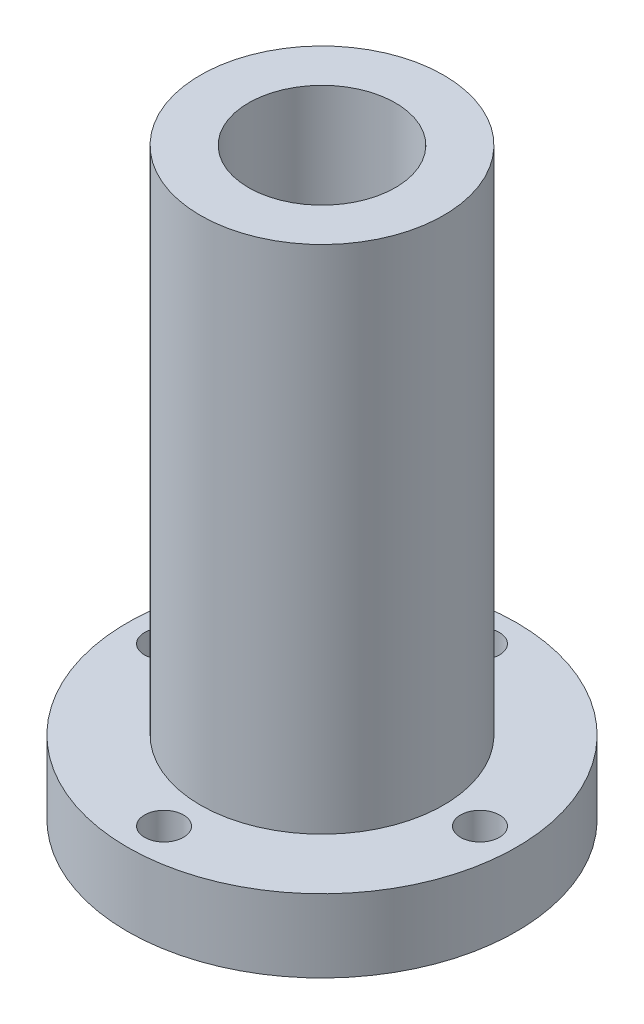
ISO-10303-21;
HEADER;
FILE_DESCRIPTION(('STEP AP214'),'2;1');
FILE_NAME('part.step','',(''),(''),'','','');
FILE_SCHEMA(('AUTOMOTIVE_DESIGN { 1 0 10303 214 1 1 1 1 }'));
ENDSEC;
DATA;
#1=APPLICATION_CONTEXT('core data for automotive mechanical design processes');
#2=APPLICATION_PROTOCOL_DEFINITION('international standard','automotive_design',2000,#1);
#3=PRODUCT_CONTEXT('',#1,'mechanical');
#4=PRODUCT('Part','Part','',(#3));
#5=PRODUCT_RELATED_PRODUCT_CATEGORY('part','',(#4));
#6=PRODUCT_DEFINITION_FORMATION('','',#4);
#7=PRODUCT_DEFINITION_CONTEXT('part definition',#1,'design');
#8=PRODUCT_DEFINITION('design','',#6,#7);
#9=PRODUCT_DEFINITION_SHAPE('','',#8);
#10=(LENGTH_UNIT() NAMED_UNIT(*) SI_UNIT(.MILLI.,.METRE.));
#11=(NAMED_UNIT(*) PLANE_ANGLE_UNIT() SI_UNIT($,.RADIAN.));
#12=(NAMED_UNIT(*) SI_UNIT($,.STERADIAN.) SOLID_ANGLE_UNIT());
#13=UNCERTAINTY_MEASURE_WITH_UNIT(LENGTH_MEASURE(1.E-05),#10,'distance_accuracy_value','');
#14=(GEOMETRIC_REPRESENTATION_CONTEXT(3) GLOBAL_UNCERTAINTY_ASSIGNED_CONTEXT((#13)) GLOBAL_UNIT_ASSIGNED_CONTEXT((#10,
#11,#12)) REPRESENTATION_CONTEXT('',''));
#15=CARTESIAN_POINT('',(0.,0.,0.));
#16=DIRECTION('',(0.,0.,1.));
#17=DIRECTION('',(1.,0.,0.));
#18=AXIS2_PLACEMENT_3D('',#15,#16,#17);
#19=CARTESIAN_POINT('',(0.,-76.2,0.));
#20=DIRECTION('',(0.,1.,0.));
#21=DIRECTION('',(0.,0.,1.));
#22=AXIS2_PLACEMENT_3D('',#19,#20,#21);
#23=CYLINDRICAL_SURFACE('',#22,25.4);
#24=CARTESIAN_POINT('',(0.,-76.2,0.));
#25=DIRECTION('',(0.,1.,0.));
#26=DIRECTION('',(0.,0.,1.));
#27=AXIS2_PLACEMENT_3D('',#24,#25,#26);
#28=CIRCLE('',#27,25.4);
#29=CARTESIAN_POINT('',(0.,-76.2,25.4));
#30=VERTEX_POINT('',#29);
#31=EDGE_CURVE('E11',#30,#30,#28,.T.);
#32=CARTESIAN_POINT('',(0.,-66.675,0.));
#33=DIRECTION('',(0.,1.,0.));
#34=DIRECTION('',(0.,0.,1.));
#35=AXIS2_PLACEMENT_3D('',#32,#33,#34);
#36=CIRCLE('',#35,25.4);
#37=CARTESIAN_POINT('',(0.,-66.675,25.4));
#38=VERTEX_POINT('',#37);
#39=EDGE_CURVE('E33',#38,#38,#36,.F.);
#40=CARTESIAN_POINT('',(0.,-76.2,25.4));
#41=CARTESIAN_POINT('',(0.,-76.10078125,25.4));
#42=CARTESIAN_POINT('',(0.,-76.0015625,25.4));
#43=CARTESIAN_POINT('',(0.,-75.803125,25.4));
#44=CARTESIAN_POINT('',(0.,-75.70390625,25.4));
#45=CARTESIAN_POINT('',(0.,-75.50546875,25.4));
#46=CARTESIAN_POINT('',(0.,-75.40625,25.4));
#47=CARTESIAN_POINT('',(0.,-75.2078125,25.4));
#48=CARTESIAN_POINT('',(0.,-75.10859375,25.4));
#49=CARTESIAN_POINT('',(0.,-74.91015625,25.4));
#50=CARTESIAN_POINT('',(0.,-74.8109375,25.4));
#51=CARTESIAN_POINT('',(0.,-74.6125,25.4));
#52=CARTESIAN_POINT('',(0.,-74.51328125,25.4));
#53=CARTESIAN_POINT('',(0.,-74.31484375,25.4));
#54=CARTESIAN_POINT('',(0.,-74.215625,25.4));
#55=CARTESIAN_POINT('',(0.,-74.0171875,25.4));
#56=CARTESIAN_POINT('',(0.,-73.91796875,25.4));
#57=CARTESIAN_POINT('',(0.,-73.71953125,25.4));
#58=CARTESIAN_POINT('',(0.,-73.6203125,25.4));
#59=CARTESIAN_POINT('',(0.,-73.421875,25.4));
#60=CARTESIAN_POINT('',(0.,-73.32265625,25.4));
#61=CARTESIAN_POINT('',(0.,-73.12421875,25.4));
#62=CARTESIAN_POINT('',(0.,-73.025,25.4));
#63=CARTESIAN_POINT('',(0.,-72.8265625,25.4));
#64=CARTESIAN_POINT('',(0.,-72.72734375,25.4));
#65=CARTESIAN_POINT('',(0.,-72.52890625,25.4));
#66=CARTESIAN_POINT('',(0.,-72.4296875,25.4));
#67=CARTESIAN_POINT('',(0.,-72.23125,25.4));
#68=CARTESIAN_POINT('',(0.,-72.13203125,25.4));
#69=CARTESIAN_POINT('',(0.,-71.93359375,25.4));
#70=CARTESIAN_POINT('',(0.,-71.834375,25.4));
#71=CARTESIAN_POINT('',(0.,-71.6359375,25.4));
#72=CARTESIAN_POINT('',(0.,-71.53671875,25.4));
#73=CARTESIAN_POINT('',(0.,-71.33828125,25.4));
#74=CARTESIAN_POINT('',(0.,-71.2390625,25.4));
#75=CARTESIAN_POINT('',(0.,-71.040625,25.4));
#76=CARTESIAN_POINT('',(0.,-70.94140625,25.4));
#77=CARTESIAN_POINT('',(0.,-70.74296875,25.4));
#78=CARTESIAN_POINT('',(0.,-70.64375,25.4));
#79=CARTESIAN_POINT('',(0.,-70.4453125,25.4));
#80=CARTESIAN_POINT('',(0.,-70.34609375,25.4));
#81=CARTESIAN_POINT('',(0.,-70.14765625,25.4));
#82=CARTESIAN_POINT('',(0.,-70.0484375,25.4));
#83=CARTESIAN_POINT('',(0.,-69.85,25.4));
#84=CARTESIAN_POINT('',(0.,-69.75078125,25.4));
#85=CARTESIAN_POINT('',(0.,-69.55234375,25.4));
#86=CARTESIAN_POINT('',(0.,-69.453125,25.4));
#87=CARTESIAN_POINT('',(0.,-69.2546875,25.4));
#88=CARTESIAN_POINT('',(0.,-69.15546875,25.4));
#89=CARTESIAN_POINT('',(0.,-68.95703125,25.4));
#90=CARTESIAN_POINT('',(0.,-68.8578125,25.4));
#91=CARTESIAN_POINT('',(0.,-68.659375,25.4));
#92=CARTESIAN_POINT('',(0.,-68.56015625,25.4));
#93=CARTESIAN_POINT('',(0.,-68.36171875,25.4));
#94=CARTESIAN_POINT('',(0.,-68.2625,25.4));
#95=CARTESIAN_POINT('',(0.,-68.0640625,25.4));
#96=CARTESIAN_POINT('',(0.,-67.96484375,25.4));
#97=CARTESIAN_POINT('',(0.,-67.76640625,25.4));
#98=CARTESIAN_POINT('',(0.,-67.6671875,25.4));
#99=CARTESIAN_POINT('',(0.,-67.46875,25.4));
#100=CARTESIAN_POINT('',(0.,-67.36953125,25.4));
#101=CARTESIAN_POINT('',(0.,-67.17109375,25.4));
#102=CARTESIAN_POINT('',(0.,-67.071875,25.4));
#103=CARTESIAN_POINT('',(0.,-66.8734375,25.4));
#104=CARTESIAN_POINT('',(0.,-66.77421875,25.4));
#105=CARTESIAN_POINT('',(0.,-66.675,25.4));
#106=B_SPLINE_CURVE_WITH_KNOTS('',3,(#40,#41,#42,#43,#44,#45,#46,#47,#48,#49,#50,#51,#52,#53,
#54,#55,#56,#57,#58,#59,#60,#61,#62,#63,#64,#65,#66,#67,#68,#69,#70,#71,#72,#73,#74,#75,#76,#77,
#78,#79,#80,#81,#82,#83,#84,#85,#86,#87,#88,#89,#90,#91,#92,#93,#94,#95,#96,#97,#98,#99,#100,
#101,#102,#103,#104,#105),.UNSPECIFIED.,.F.,.F.,(4,2,2,2,2,2,2,2,2,2,2,2,2,2,2,2,2,2,2,2,2,2,2,
2,2,2,2,2,2,2,2,2,4),(0.,0.297656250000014,0.595312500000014,0.892968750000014,1.19062500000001,
1.48828125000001,1.78593750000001,2.08359375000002,2.38125000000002,2.67890625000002,
2.97656250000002,3.27421875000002,3.57187500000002,3.86953125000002,4.16718750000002,
4.46484375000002,4.76250000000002,5.06015625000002,5.35781250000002,5.65546875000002,
5.95312500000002,6.25078125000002,6.54843750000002,6.84609375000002,7.14375000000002,
7.44140625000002,7.73906250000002,8.03671875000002,8.33437500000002,8.63203125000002,
8.92968750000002,9.22734375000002,9.52500000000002),.UNSPECIFIED.);
#107=EDGE_CURVE('BSEAM30',#30,#38,#106,.T.);
#108=ORIENTED_EDGE('',*,*,#31,.T.);
#109=ORIENTED_EDGE('',*,*,#39,.T.);
#110=ORIENTED_EDGE('',*,*,#107,.T.);
#111=ORIENTED_EDGE('',*,*,#107,.F.);
#112=EDGE_LOOP('',(#108,#110,#109,#111));
#113=FACE_BOUND('',#112,.T.);
#114=ADVANCED_FACE('F30',(#113),#23,.T.);
#115=CARTESIAN_POINT('',(0.,0.,0.));
#116=DIRECTION('',(0.,1.,0.));
#117=DIRECTION('',(0.,0.,1.));
#118=AXIS2_PLACEMENT_3D('',#115,#116,#117);
#119=PLANE('',#118);
#120=CARTESIAN_POINT('',(0.,0.,0.));
#121=DIRECTION('',(0.,1.,0.));
#122=DIRECTION('',(0.,0.,1.));
#123=AXIS2_PLACEMENT_3D('',#120,#121,#122);
#124=CIRCLE('',#123,9.5885);
#125=CARTESIAN_POINT('',(0.,0.,9.5885));
#126=VERTEX_POINT('',#125);
#127=EDGE_CURVE('E41',#126,#126,#124,.T.);
#128=ORIENTED_EDGE('',*,*,#127,.F.);
#129=EDGE_LOOP('',(#128));
#130=FACE_BOUND('',#129,.T.);
#131=CARTESIAN_POINT('',(0.,0.,0.));
#132=DIRECTION('',(0.,1.,0.));
#133=DIRECTION('',(0.,0.,1.));
#134=AXIS2_PLACEMENT_3D('',#131,#132,#133);
#135=CIRCLE('',#134,15.875);
#136=CARTESIAN_POINT('',(0.,0.,15.875));
#137=VERTEX_POINT('',#136);
#138=EDGE_CURVE('E49',#137,#137,#135,.T.);
#139=ORIENTED_EDGE('',*,*,#138,.T.);
#140=EDGE_LOOP('',(#139));
#141=FACE_BOUND('',#140,.T.);
#142=ADVANCED_FACE('F102',(#130,#141),#119,.T.);
#143=CARTESIAN_POINT('',(0.,-76.2,0.));
#144=DIRECTION('',(0.,1.,0.));
#145=DIRECTION('',(0.,0.,1.));
#146=AXIS2_PLACEMENT_3D('',#143,#144,#145);
#147=PLANE('',#146);
#148=CARTESIAN_POINT('',(-20.6248,-76.2,0.));
#149=DIRECTION('',(0.,1.,0.));
#150=DIRECTION('',(0.,0.,1.));
#151=AXIS2_PLACEMENT_3D('',#148,#149,#150);
#152=CIRCLE('',#151,2.54);
#153=CARTESIAN_POINT('',(-20.6248,-76.2,2.54));
#154=VERTEX_POINT('',#153);
#155=EDGE_CURVE('E70',#154,#154,#152,.T.);
#156=ORIENTED_EDGE('',*,*,#155,.T.);
#157=EDGE_LOOP('',(#156));
#158=FACE_BOUND('',#157,.T.);
#159=CARTESIAN_POINT('',(20.6248,-76.2,0.));
#160=DIRECTION('',(0.,1.,0.));
#161=DIRECTION('',(0.,0.,1.));
#162=AXIS2_PLACEMENT_3D('',#159,#160,#161);
#163=CIRCLE('',#162,2.54);
#164=CARTESIAN_POINT('',(20.6248,-76.2,2.54));
#165=VERTEX_POINT('',#164);
#166=EDGE_CURVE('E64',#165,#165,#163,.T.);
#167=ORIENTED_EDGE('',*,*,#166,.T.);
#168=EDGE_LOOP('',(#167));
#169=FACE_BOUND('',#168,.T.);
#170=CARTESIAN_POINT('',(0.,-76.2,20.6248));
#171=DIRECTION('',(0.,1.,0.));
#172=DIRECTION('',(0.,0.,1.));
#173=AXIS2_PLACEMENT_3D('',#170,#171,#172);
#174=CIRCLE('',#173,2.54);
#175=CARTESIAN_POINT('',(0.,-76.2,23.1648));
#176=VERTEX_POINT('',#175);
#177=EDGE_CURVE('E58',#176,#176,#174,.T.);
#178=ORIENTED_EDGE('',*,*,#177,.T.);
#179=EDGE_LOOP('',(#178));
#180=FACE_BOUND('',#179,.T.);
#181=CARTESIAN_POINT('',(0.,-76.2,-20.6248));
#182=DIRECTION('',(0.,1.,0.));
#183=DIRECTION('',(0.,0.,1.));
#184=AXIS2_PLACEMENT_3D('',#181,#182,#183);
#185=CIRCLE('',#184,2.54);
#186=CARTESIAN_POINT('',(0.,-76.2,-18.0848));
#187=VERTEX_POINT('',#186);
#188=EDGE_CURVE('E52',#187,#187,#185,.T.);
#189=ORIENTED_EDGE('',*,*,#188,.T.);
#190=EDGE_LOOP('',(#189));
#191=FACE_BOUND('',#190,.T.);
#192=CARTESIAN_POINT('',(0.,-76.2,0.));
#193=DIRECTION('',(0.,1.,0.));
#194=DIRECTION('',(0.,0.,1.));
#195=AXIS2_PLACEMENT_3D('',#192,#193,#194);
#196=CIRCLE('',#195,9.5885);
#197=CARTESIAN_POINT('',(0.,-76.2,9.5885));
#198=VERTEX_POINT('',#197);
#199=EDGE_CURVE('E37',#198,#198,#196,.T.);
#200=ORIENTED_EDGE('',*,*,#199,.T.);
#201=EDGE_LOOP('',(#200));
#202=FACE_BOUND('',#201,.T.);
#203=ORIENTED_EDGE('',*,*,#31,.F.);
#204=EDGE_LOOP('',(#203));
#205=FACE_BOUND('',#204,.T.);
#206=ADVANCED_FACE('F104',(#158,#169,#180,#191,#202,#205),#147,.F.);
#207=CARTESIAN_POINT('',(0.,-76.2,0.));
#208=DIRECTION('',(0.,1.,0.));
#209=DIRECTION('',(0.,0.,1.));
#210=AXIS2_PLACEMENT_3D('',#207,#208,#209);
#211=CYLINDRICAL_SURFACE('',#210,9.5885);
#212=CARTESIAN_POINT('',(0.,-76.2,9.5885));
#213=CARTESIAN_POINT('',(0.,-75.40625,9.5885));
#214=CARTESIAN_POINT('',(0.,-74.6125,9.5885));
#215=CARTESIAN_POINT('',(0.,-73.025,9.5885));
#216=CARTESIAN_POINT('',(0.,-72.23125,9.5885));
#217=CARTESIAN_POINT('',(0.,-70.64375,9.5885));
#218=CARTESIAN_POINT('',(0.,-69.85,9.5885));
#219=CARTESIAN_POINT('',(0.,-68.2625,9.5885));
#220=CARTESIAN_POINT('',(0.,-67.46875,9.5885));
#221=CARTESIAN_POINT('',(0.,-65.88125,9.5885));
#222=CARTESIAN_POINT('',(0.,-65.0875,9.5885));
#223=CARTESIAN_POINT('',(0.,-63.5,9.5885));
#224=CARTESIAN_POINT('',(0.,-62.70625,9.5885));
#225=CARTESIAN_POINT('',(0.,-61.11875,9.5885));
#226=CARTESIAN_POINT('',(0.,-60.325,9.5885));
#227=CARTESIAN_POINT('',(0.,-58.7375,9.5885));
#228=CARTESIAN_POINT('',(0.,-57.94375,9.5885));
#229=CARTESIAN_POINT('',(0.,-56.35625,9.5885));
#230=CARTESIAN_POINT('',(0.,-55.5625,9.5885));
#231=CARTESIAN_POINT('',(0.,-53.975,9.5885));
#232=CARTESIAN_POINT('',(0.,-53.18125,9.5885));
#233=CARTESIAN_POINT('',(0.,-51.59375,9.5885));
#234=CARTESIAN_POINT('',(0.,-50.8,9.5885));
#235=CARTESIAN_POINT('',(0.,-49.2125,9.5885));
#236=CARTESIAN_POINT('',(0.,-48.41875,9.5885));
#237=CARTESIAN_POINT('',(0.,-46.83125,9.5885));
#238=CARTESIAN_POINT('',(0.,-46.0375,9.5885));
#239=CARTESIAN_POINT('',(0.,-44.45,9.5885));
#240=CARTESIAN_POINT('',(0.,-43.65625,9.5885));
#241=CARTESIAN_POINT('',(0.,-42.06875,9.5885));
#242=CARTESIAN_POINT('',(0.,-41.275,9.5885));
#243=CARTESIAN_POINT('',(0.,-39.6875,9.5885));
#244=CARTESIAN_POINT('',(0.,-38.89375,9.5885));
#245=CARTESIAN_POINT('',(0.,-37.30625,9.5885));
#246=CARTESIAN_POINT('',(0.,-36.5125,9.5885));
#247=CARTESIAN_POINT('',(0.,-34.925,9.5885));
#248=CARTESIAN_POINT('',(0.,-34.13125,9.5885));
#249=CARTESIAN_POINT('',(0.,-32.54375,9.5885));
#250=CARTESIAN_POINT('',(0.,-31.75,9.5885));
#251=CARTESIAN_POINT('',(0.,-30.1625,9.5885));
#252=CARTESIAN_POINT('',(0.,-29.36875,9.5885));
#253=CARTESIAN_POINT('',(0.,-27.78125,9.5885));
#254=CARTESIAN_POINT('',(0.,-26.9875,9.5885));
#255=CARTESIAN_POINT('',(0.,-25.4,9.5885));
#256=CARTESIAN_POINT('',(0.,-24.60625,9.5885));
#257=CARTESIAN_POINT('',(0.,-23.01875,9.5885));
#258=CARTESIAN_POINT('',(0.,-22.225,9.5885));
#259=CARTESIAN_POINT('',(0.,-20.6375,9.5885));
#260=CARTESIAN_POINT('',(0.,-19.84375,9.5885));
#261=CARTESIAN_POINT('',(0.,-18.25625,9.5885));
#262=CARTESIAN_POINT('',(0.,-17.4625,9.5885));
#263=CARTESIAN_POINT('',(0.,-15.875,9.5885));
#264=CARTESIAN_POINT('',(0.,-15.08125,9.5885));
#265=CARTESIAN_POINT('',(0.,-13.49375,9.5885));
#266=CARTESIAN_POINT('',(0.,-12.7,9.5885));
#267=CARTESIAN_POINT('',(0.,-11.1125,9.5885));
#268=CARTESIAN_POINT('',(0.,-10.31875,9.5885));
#269=CARTESIAN_POINT('',(0.,-8.73125,9.5885));
#270=CARTESIAN_POINT('',(0.,-7.93750000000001,9.5885));
#271=CARTESIAN_POINT('',(0.,-6.35,9.5885));
#272=CARTESIAN_POINT('',(0.,-5.55625,9.5885));
#273=CARTESIAN_POINT('',(0.,-3.96875,9.5885));
#274=CARTESIAN_POINT('',(0.,-3.175,9.5885));
#275=CARTESIAN_POINT('',(0.,-1.5875,9.5885));
#276=CARTESIAN_POINT('',(0.,-0.793750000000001,9.5885));
#277=CARTESIAN_POINT('',(0.,0.,9.5885));
#278=B_SPLINE_CURVE_WITH_KNOTS('',3,(#212,#213,#214,#215,#216,#217,#218,#219,#220,#221,#222,
#223,#224,#225,#226,#227,#228,#229,#230,#231,#232,#233,#234,#235,#236,#237,#238,#239,#240,#241,
#242,#243,#244,#245,#246,#247,#248,#249,#250,#251,#252,#253,#254,#255,#256,#257,#258,#259,#260,
#261,#262,#263,#264,#265,#266,#267,#268,#269,#270,#271,#272,#273,#274,#275,#276,#277),
.UNSPECIFIED.,.F.,.F.,(4,2,2,2,2,2,2,2,2,2,2,2,2,2,2,2,2,2,2,2,2,2,2,2,2,2,2,2,2,2,2,2,4),(0.,
2.38124999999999,4.76249999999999,7.14374999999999,9.52499999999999,11.90625,14.2875,16.66875,
19.05,21.43125,23.8125,26.19375,28.575,30.95625,33.3375,35.71875,38.1,40.48125,42.8625,45.24375,
47.625,50.00625,52.3875,54.76875,57.15,59.53125,61.9125,64.29375,66.675,69.05625,71.4375,
73.81875,76.2),.UNSPECIFIED.);
#279=EDGE_CURVE('BSEAM83',#198,#126,#278,.T.);
#280=ORIENTED_EDGE('',*,*,#199,.F.);
#281=ORIENTED_EDGE('',*,*,#127,.T.);
#282=ORIENTED_EDGE('',*,*,#279,.T.);
#283=ORIENTED_EDGE('',*,*,#279,.F.);
#284=EDGE_LOOP('',(#280,#282,#281,#283));
#285=FACE_BOUND('',#284,.T.);
#286=ADVANCED_FACE('F83',(#285),#211,.F.);
#287=CARTESIAN_POINT('',(0.,-66.675,0.));
#288=DIRECTION('',(0.,1.,0.));
#289=DIRECTION('',(0.,0.,1.));
#290=AXIS2_PLACEMENT_3D('',#287,#288,#289);
#291=PLANE('',#290);
#292=CARTESIAN_POINT('',(-20.6248,-66.675,0.));
#293=DIRECTION('',(0.,1.,0.));
#294=DIRECTION('',(0.,0.,1.));
#295=AXIS2_PLACEMENT_3D('',#292,#293,#294);
#296=CIRCLE('',#295,2.54);
#297=CARTESIAN_POINT('',(-20.6248,-66.675,2.54));
#298=VERTEX_POINT('',#297);
#299=EDGE_CURVE('E73',#298,#298,#296,.T.);
#300=ORIENTED_EDGE('',*,*,#299,.F.);
#301=EDGE_LOOP('',(#300));
#302=FACE_BOUND('',#301,.T.);
#303=CARTESIAN_POINT('',(20.6248,-66.675,0.));
#304=DIRECTION('',(0.,1.,0.));
#305=DIRECTION('',(0.,0.,1.));
#306=AXIS2_PLACEMENT_3D('',#303,#304,#305);
#307=CIRCLE('',#306,2.54);
#308=CARTESIAN_POINT('',(20.6248,-66.675,2.54));
#309=VERTEX_POINT('',#308);
#310=EDGE_CURVE('E67',#309,#309,#307,.T.);
#311=ORIENTED_EDGE('',*,*,#310,.F.);
#312=EDGE_LOOP('',(#311));
#313=FACE_BOUND('',#312,.T.);
#314=CARTESIAN_POINT('',(0.,-66.675,20.6248));
#315=DIRECTION('',(0.,1.,0.));
#316=DIRECTION('',(0.,0.,1.));
#317=AXIS2_PLACEMENT_3D('',#314,#315,#316);
#318=CIRCLE('',#317,2.54);
#319=CARTESIAN_POINT('',(0.,-66.675,23.1648));
#320=VERTEX_POINT('',#319);
#321=EDGE_CURVE('E61',#320,#320,#318,.T.);
#322=ORIENTED_EDGE('',*,*,#321,.F.);
#323=EDGE_LOOP('',(#322));
#324=FACE_BOUND('',#323,.T.);
#325=CARTESIAN_POINT('',(0.,-66.675,-20.6248));
#326=DIRECTION('',(0.,1.,0.));
#327=DIRECTION('',(0.,0.,1.));
#328=AXIS2_PLACEMENT_3D('',#325,#326,#327);
#329=CIRCLE('',#328,2.54);
#330=CARTESIAN_POINT('',(0.,-66.675,-18.0848));
#331=VERTEX_POINT('',#330);
#332=EDGE_CURVE('E55',#331,#331,#329,.T.);
#333=ORIENTED_EDGE('',*,*,#332,.F.);
#334=EDGE_LOOP('',(#333));
#335=FACE_BOUND('',#334,.T.);
#336=ORIENTED_EDGE('',*,*,#39,.F.);
#337=EDGE_LOOP('',(#336));
#338=FACE_BOUND('',#337,.T.);
#339=CARTESIAN_POINT('',(0.,-66.675,0.));
#340=DIRECTION('',(0.,1.,0.));
#341=DIRECTION('',(0.,0.,1.));
#342=AXIS2_PLACEMENT_3D('',#339,#340,#341);
#343=CIRCLE('',#342,15.875);
#344=CARTESIAN_POINT('',(0.,-66.675,15.875));
#345=VERTEX_POINT('',#344);
#346=EDGE_CURVE('E46',#345,#345,#343,.T.);
#347=ORIENTED_EDGE('',*,*,#346,.F.);
#348=EDGE_LOOP('',(#347));
#349=FACE_BOUND('',#348,.T.);
#350=ADVANCED_FACE('F79',(#302,#313,#324,#335,#338,#349),#291,.T.);
#351=CARTESIAN_POINT('',(0.,-66.675,0.));
#352=DIRECTION('',(0.,1.,0.));
#353=DIRECTION('',(0.,0.,1.));
#354=AXIS2_PLACEMENT_3D('',#351,#352,#353);
#355=CYLINDRICAL_SURFACE('',#354,15.875);
#356=ORIENTED_EDGE('',*,*,#346,.T.);
#357=EDGE_LOOP('',(#356));
#358=FACE_BOUND('',#357,.T.);
#359=ORIENTED_EDGE('',*,*,#138,.F.);
#360=EDGE_LOOP('',(#359));
#361=FACE_BOUND('',#360,.T.);
#362=ADVANCED_FACE('F82',(#358,#361),#355,.T.);
#363=CARTESIAN_POINT('',(0.,-76.2,-20.6248));
#364=DIRECTION('',(0.,1.,0.));
#365=DIRECTION('',(0.,0.,1.));
#366=AXIS2_PLACEMENT_3D('',#363,#364,#365);
#367=CYLINDRICAL_SURFACE('',#366,2.54);
#368=ORIENTED_EDGE('',*,*,#188,.F.);
#369=EDGE_LOOP('',(#368));
#370=FACE_BOUND('',#369,.T.);
#371=ORIENTED_EDGE('',*,*,#332,.T.);
#372=EDGE_LOOP('',(#371));
#373=FACE_BOUND('',#372,.T.);
#374=ADVANCED_FACE('F98',(#370,#373),#367,.F.);
#375=CARTESIAN_POINT('',(0.,-76.2,20.6248));
#376=DIRECTION('',(0.,1.,0.));
#377=DIRECTION('',(0.,0.,1.));
#378=AXIS2_PLACEMENT_3D('',#375,#376,#377);
#379=CYLINDRICAL_SURFACE('',#378,2.54);
#380=ORIENTED_EDGE('',*,*,#177,.F.);
#381=EDGE_LOOP('',(#380));
#382=FACE_BOUND('',#381,.T.);
#383=ORIENTED_EDGE('',*,*,#321,.T.);
#384=EDGE_LOOP('',(#383));
#385=FACE_BOUND('',#384,.T.);
#386=ADVANCED_FACE('F119',(#382,#385),#379,.F.);
#387=CARTESIAN_POINT('',(20.6248,-76.2,0.));
#388=DIRECTION('',(0.,1.,0.));
#389=DIRECTION('',(0.,0.,1.));
#390=AXIS2_PLACEMENT_3D('',#387,#388,#389);
#391=CYLINDRICAL_SURFACE('',#390,2.54);
#392=ORIENTED_EDGE('',*,*,#166,.F.);
#393=EDGE_LOOP('',(#392));
#394=FACE_BOUND('',#393,.T.);
#395=ORIENTED_EDGE('',*,*,#310,.T.);
#396=EDGE_LOOP('',(#395));
#397=FACE_BOUND('',#396,.T.);
#398=ADVANCED_FACE('F123',(#394,#397),#391,.F.);
#399=CARTESIAN_POINT('',(-20.6248,-76.2,0.));
#400=DIRECTION('',(0.,1.,0.));
#401=DIRECTION('',(0.,0.,1.));
#402=AXIS2_PLACEMENT_3D('',#399,#400,#401);
#403=CYLINDRICAL_SURFACE('',#402,2.54);
#404=ORIENTED_EDGE('',*,*,#155,.F.);
#405=EDGE_LOOP('',(#404));
#406=FACE_BOUND('',#405,.T.);
#407=ORIENTED_EDGE('',*,*,#299,.T.);
#408=EDGE_LOOP('',(#407));
#409=FACE_BOUND('',#408,.T.);
#410=ADVANCED_FACE('F77',(#406,#409),#403,.F.);
#411=CLOSED_SHELL('',(#114,#142,#206,#286,#350,#362,#374,#386,#398,#410));
#412=MANIFOLD_SOLID_BREP('B2',#411);
#413=ADVANCED_BREP_SHAPE_REPRESENTATION('',(#18,#412),#14);
#414=SHAPE_DEFINITION_REPRESENTATION(#9,#413);
ENDSEC;
END-ISO-10303-21;
